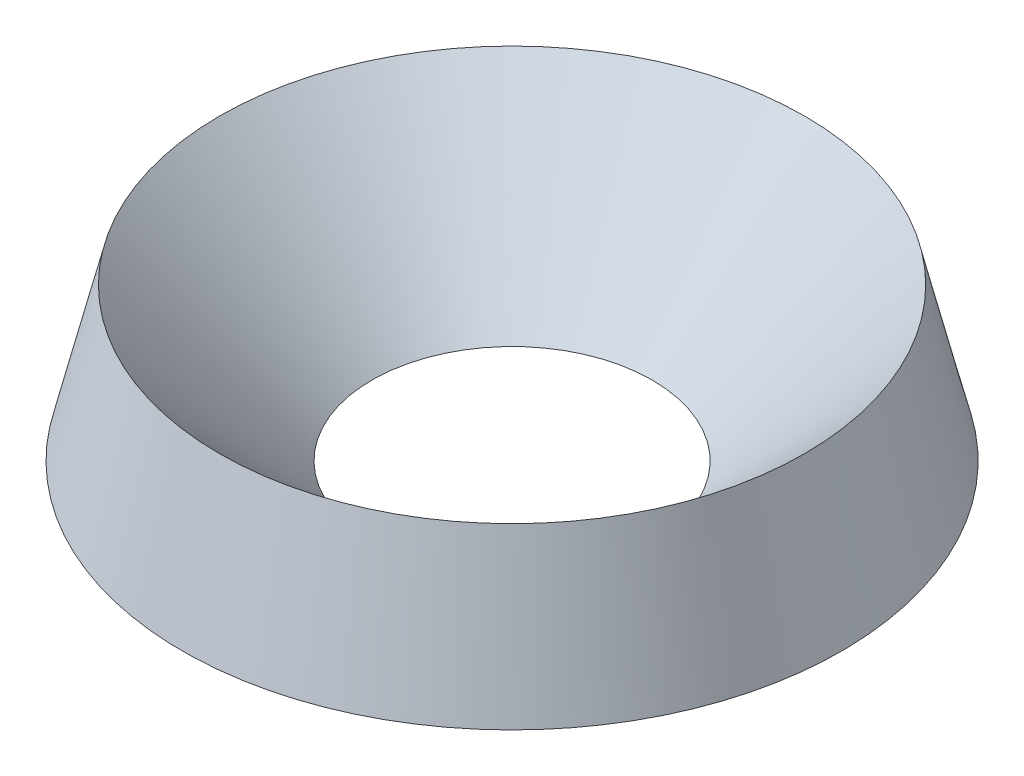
ISO-10303-21;
HEADER;
FILE_DESCRIPTION(('STEP AP214'),'2;1');
FILE_NAME('part.step','',(''),(''),'','','');
FILE_SCHEMA(('AUTOMOTIVE_DESIGN { 1 0 10303 214 1 1 1 1 }'));
ENDSEC;
DATA;
#1=APPLICATION_CONTEXT('core data for automotive mechanical design processes');
#2=APPLICATION_PROTOCOL_DEFINITION('international standard','automotive_design',2000,#1);
#3=PRODUCT_CONTEXT('',#1,'mechanical');
#4=PRODUCT('Part','Part','',(#3));
#5=PRODUCT_RELATED_PRODUCT_CATEGORY('part','',(#4));
#6=PRODUCT_DEFINITION_FORMATION('','',#4);
#7=PRODUCT_DEFINITION_CONTEXT('part definition',#1,'design');
#8=PRODUCT_DEFINITION('design','',#6,#7);
#9=PRODUCT_DEFINITION_SHAPE('','',#8);
#10=(LENGTH_UNIT() NAMED_UNIT(*) SI_UNIT(.MILLI.,.METRE.));
#11=(NAMED_UNIT(*) PLANE_ANGLE_UNIT() SI_UNIT($,.RADIAN.));
#12=(NAMED_UNIT(*) SI_UNIT($,.STERADIAN.) SOLID_ANGLE_UNIT());
#13=UNCERTAINTY_MEASURE_WITH_UNIT(LENGTH_MEASURE(1.E-05),#10,'distance_accuracy_value','');
#14=(GEOMETRIC_REPRESENTATION_CONTEXT(3) GLOBAL_UNCERTAINTY_ASSIGNED_CONTEXT((#13)) GLOBAL_UNIT_ASSIGNED_CONTEXT((#10,
#11,#12)) REPRESENTATION_CONTEXT('',''));
#15=CARTESIAN_POINT('',(0.,0.,0.));
#16=DIRECTION('',(0.,0.,1.));
#17=DIRECTION('',(1.,0.,0.));
#18=AXIS2_PLACEMENT_3D('',#15,#16,#17);
#19=CARTESIAN_POINT('',(-1.66533453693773E-13,0.,1.37390099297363E-12));
#20=DIRECTION('',(0.,-1.,0.));
#21=DIRECTION('',(0.,0.,-1.00000000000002));
#22=AXIS2_PLACEMENT_3D('',#19,#20,#21);
#23=CONICAL_SURFACE('',#22,8.,0.238609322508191);
#24=CARTESIAN_POINT('',(1.11022302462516E-13,3.69999999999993,2.5951463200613E-12));
#25=DIRECTION('',(0.,-1.,0.));
#26=DIRECTION('',(0.,0.,-1.00000000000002));
#27=AXIS2_PLACEMENT_3D('',#24,#25,#26);
#28=CIRCLE('',#27,7.10000000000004);
#29=CARTESIAN_POINT('',(1.40581990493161E-13,3.69999999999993,-7.09999999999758));
#30=VERTEX_POINT('',#29);
#31=EDGE_CURVE('E49',#30,#30,#28,.T.);
#32=ORIENTED_EDGE('',*,*,#31,.T.);
#33=EDGE_LOOP('',(#32));
#34=FACE_BOUND('',#33,.T.);
#35=CARTESIAN_POINT('',(-1.66533453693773E-13,0.,1.37390099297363E-12));
#36=DIRECTION('',(0.,-1.,0.));
#37=DIRECTION('',(0.,0.,-1.00000000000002));
#38=AXIS2_PLACEMENT_3D('',#35,#36,#37);
#39=CIRCLE('',#38,8.);
#40=CARTESIAN_POINT('',(-1.33226762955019E-13,0.,-7.99999999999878));
#41=VERTEX_POINT('',#40);
#42=EDGE_CURVE('E10',#41,#41,#39,.T.);
#43=ORIENTED_EDGE('',*,*,#42,.F.);
#44=EDGE_LOOP('',(#43));
#45=FACE_BOUND('',#44,.T.);
#46=ADVANCED_FACE('F36',(#34,#45),#23,.T.);
#47=CARTESIAN_POINT('',(7.99999999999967,-2.22044604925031E-13,9.99200722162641E-13));
#48=DIRECTION('',(0.,-1.,0.));
#49=DIRECTION('',(0.,0.,-1.00000000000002));
#50=AXIS2_PLACEMENT_3D('',#47,#48,#49);
#51=PLANE('',#50);
#52=ORIENTED_EDGE('',*,*,#42,.T.);
#53=EDGE_LOOP('',(#52));
#54=FACE_BOUND('',#53,.T.);
#55=CARTESIAN_POINT('',(-1.66533453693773E-13,0.,1.37390099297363E-12));
#56=DIRECTION('',(0.,-1.,0.));
#57=DIRECTION('',(0.,0.,-1.00000000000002));
#58=AXIS2_PLACEMENT_3D('',#55,#56,#57);
#59=CIRCLE('',#58,3.4);
#60=CARTESIAN_POINT('',(-1.52378110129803E-13,0.,-3.39999999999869));
#61=VERTEX_POINT('',#60);
#62=EDGE_CURVE('E43',#61,#61,#59,.T.);
#63=ORIENTED_EDGE('',*,*,#62,.F.);
#64=EDGE_LOOP('',(#63));
#65=FACE_BOUND('',#64,.T.);
#66=ADVANCED_FACE('F60',(#54,#65),#51,.T.);
#67=CARTESIAN_POINT('',(1.11022302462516E-13,3.69999999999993,2.5951463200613E-12));
#68=DIRECTION('',(0.,1.,0.));
#69=DIRECTION('',(0.,0.,1.00000000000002));
#70=AXIS2_PLACEMENT_3D('',#67,#68,#69);
#71=CONICAL_SURFACE('',#70,7.10000000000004,0.785398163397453);
#72=ORIENTED_EDGE('',*,*,#62,.T.);
#73=EDGE_LOOP('',(#72));
#74=FACE_BOUND('',#73,.T.);
#75=ORIENTED_EDGE('',*,*,#31,.F.);
#76=EDGE_LOOP('',(#75));
#77=FACE_BOUND('',#76,.T.);
#78=ADVANCED_FACE('F58',(#74,#77),#71,.F.);
#79=CLOSED_SHELL('',(#46,#66,#78));
#80=MANIFOLD_SOLID_BREP('B2',#79);
#81=ADVANCED_BREP_SHAPE_REPRESENTATION('',(#18,#80),#14);
#82=SHAPE_DEFINITION_REPRESENTATION(#9,#81);
ENDSEC;
END-ISO-10303-21;
